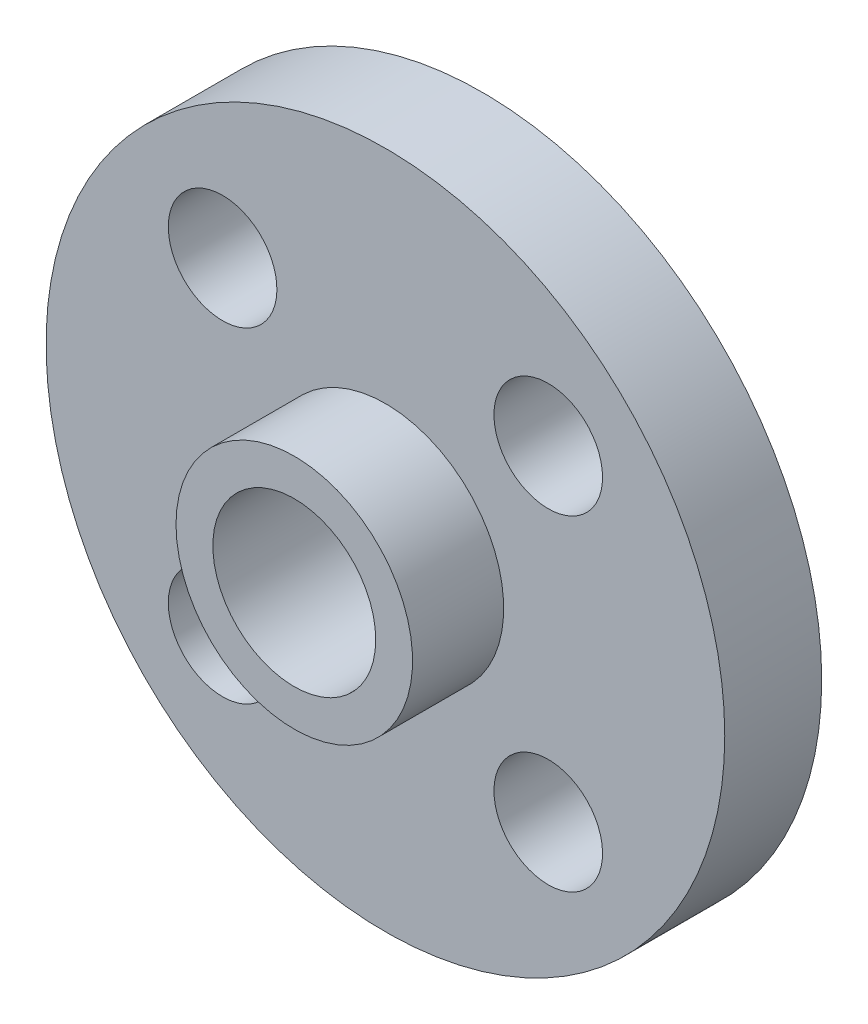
from build123d import *

# Parameters (mm, degrees)
SKETCH1_R          = 44.45
EXTRUDE1_DEPTH     = 12.7
SKETCH3_R          = 15.494
EXTRUDE2_DEPTH     = 24.638
SKETCH4_R          = 7.112
CUT_EXTRUDE1_DEPTH = 65.131856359
CIRPATTERN1_COUNT  = 4
SKETCH5_R          = 18.034
EXTRUDE3_DEPTH     = 0.79375
SKETCH6_R          = 10.668
CUT_EXTRUDE2_DEPTH = 16.66875
CUT_EXTRUDE3_REACH = 69.811
SKETCH7_R          = 7.62


with BuildPart() as part:
    # Sketch1 → Extrude1 (new body)
    with BuildSketch(Plane.XY):
        Circle(SKETCH1_R)
    extrude(amount=EXTRUDE1_DEPTH)

    # Sketch3 → Extrude2 (add)
    with BuildSketch(Plane(origin=(0, 0, 0), x_dir=(-1, 0, 0), z_dir=(0, 0, -1))):
        Circle(SKETCH3_R)
    extrude(amount=-EXTRUDE2_DEPTH)

    # Sketch4 → Cut-Extrude1 (cut, through all)
    with BuildSketch(Plane.XY.offset(12.7)):
        with Locations((21.328108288, 21.328108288)):
            Circle(SKETCH4_R)
    cut_extrude1 = extrude(amount=-CUT_EXTRUDE1_DEPTH, mode=Mode.SUBTRACT)

    # CirPattern1: Cut-Extrude1 ×4 about axis
    cirpattern1_axis = Axis((0, 0, 0), (0, 0, 1))
    for i in range(1, CIRPATTERN1_COUNT):
        add(cut_extrude1.rotate(cirpattern1_axis, i * 360 / CIRPATTERN1_COUNT), mode=Mode.SUBTRACT)

    # Sketch5 → Extrude3 (add)
    with BuildSketch(Plane(origin=(0, 0, 0), x_dir=(-1, 0, 0), z_dir=(0, 0, -1))):
        with Locations(Location((0, 0, 0), (0, 0, 180))):
            Circle(SKETCH5_R)
    extrude(amount=EXTRUDE3_DEPTH)

    # Sketch6 → Cut-Extrude2 (cut)
    with BuildSketch(Plane.XY.offset(24.638)):
        Circle(SKETCH6_R)
    extrude(amount=-CUT_EXTRUDE2_DEPTH, mode=Mode.SUBTRACT)

    # Sketch7 → Cut-Extrude3 (cut, up to next)
    with BuildSketch(Plane(origin=(0, 0, -0.79375), x_dir=(-1, 0, 0), z_dir=(0, 0, -1)), mode=Mode.PRIVATE) as cut_extrude3_sk1:
        Circle(SKETCH7_R)
    cut_extrude3_tool1 = extrude(cut_extrude3_sk1.sketch, amount=-CUT_EXTRUDE3_REACH, mode=Mode.PRIVATE) & part.part
    add(cut_extrude3_tool1.solids().sort_by_distance((0, 0, -0.79375))[0], mode=Mode.SUBTRACT)


solid = part.part
